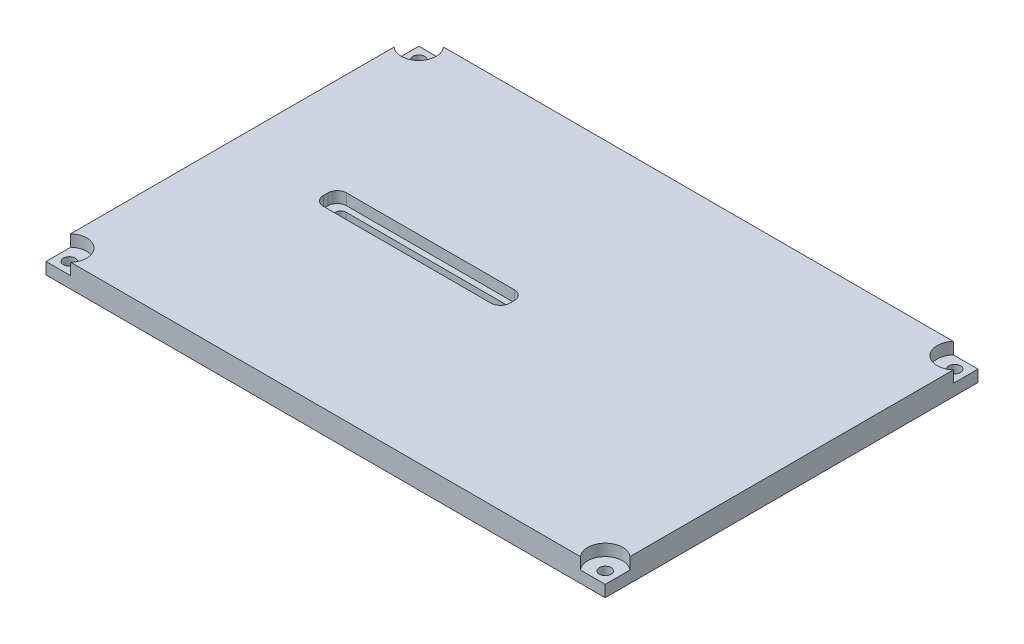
ISO-10303-21;
HEADER;
FILE_DESCRIPTION(('STEP AP214'),'2;1');
FILE_NAME('part.step','',(''),(''),'','','');
FILE_SCHEMA(('AUTOMOTIVE_DESIGN { 1 0 10303 214 1 1 1 1 }'));
ENDSEC;
DATA;
#1=APPLICATION_CONTEXT('core data for automotive mechanical design processes');
#2=APPLICATION_PROTOCOL_DEFINITION('international standard','automotive_design',2000,#1);
#3=PRODUCT_CONTEXT('',#1,'mechanical');
#4=PRODUCT('Part','Part','',(#3));
#5=PRODUCT_RELATED_PRODUCT_CATEGORY('part','',(#4));
#6=PRODUCT_DEFINITION_FORMATION('','',#4);
#7=PRODUCT_DEFINITION_CONTEXT('part definition',#1,'design');
#8=PRODUCT_DEFINITION('design','',#6,#7);
#9=PRODUCT_DEFINITION_SHAPE('','',#8);
#10=(LENGTH_UNIT() NAMED_UNIT(*) SI_UNIT(.MILLI.,.METRE.));
#11=(NAMED_UNIT(*) PLANE_ANGLE_UNIT() SI_UNIT($,.RADIAN.));
#12=(NAMED_UNIT(*) SI_UNIT($,.STERADIAN.) SOLID_ANGLE_UNIT());
#13=UNCERTAINTY_MEASURE_WITH_UNIT(LENGTH_MEASURE(1.E-05),#10,'distance_accuracy_value','');
#14=(GEOMETRIC_REPRESENTATION_CONTEXT(3) GLOBAL_UNCERTAINTY_ASSIGNED_CONTEXT((#13)) GLOBAL_UNIT_ASSIGNED_CONTEXT((#10,
#11,#12)) REPRESENTATION_CONTEXT('',''));
#15=CARTESIAN_POINT('',(0.,0.,0.));
#16=DIRECTION('',(0.,0.,1.));
#17=DIRECTION('',(1.,0.,0.));
#18=AXIS2_PLACEMENT_3D('',#15,#16,#17);
#19=CARTESIAN_POINT('',(76.2,6.35,-50.8));
#20=DIRECTION('',(0.,-1.,0.));
#21=DIRECTION('',(0.,0.,-1.));
#22=AXIS2_PLACEMENT_3D('',#19,#20,#21);
#23=PLANE('',#22);
#24=DIRECTION('',(-1.,0.,0.));
#25=VECTOR('',#24,1.);
#26=CARTESIAN_POINT('',(-50.8,6.35,-3.17500000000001));
#27=LINE('',#26,#25);
#28=CARTESIAN_POINT('',(-2.53999999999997,6.35,-3.17500000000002));
#29=VERTEX_POINT('',#28);
#30=CARTESIAN_POINT('',(-48.26,6.35,-3.17500000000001));
#31=VERTEX_POINT('',#30);
#32=EDGE_CURVE('E334',#29,#31,#27,.T.);
#33=ORIENTED_EDGE('',*,*,#32,.F.);
#34=CARTESIAN_POINT('',(-2.53999999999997,6.35,-0.635000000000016));
#35=DIRECTION('',(0.,-1.,0.));
#36=DIRECTION('',(0.,0.,-1.));
#37=AXIS2_PLACEMENT_3D('',#34,#35,#36);
#38=CIRCLE('',#37,2.54);
#39=CARTESIAN_POINT('',(0.,6.35,-0.635000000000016));
#40=VERTEX_POINT('',#39);
#41=EDGE_CURVE('E434',#29,#40,#38,.T.);
#42=ORIENTED_EDGE('',*,*,#41,.T.);
#43=DIRECTION('',(0.,0.,-1.));
#44=VECTOR('',#43,1.);
#45=CARTESIAN_POINT('',(0.,6.35,-3.17500000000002));
#46=LINE('',#45,#44);
#47=CARTESIAN_POINT('',(0.,6.35,0.634999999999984));
#48=VERTEX_POINT('',#47);
#49=EDGE_CURVE('E307',#48,#40,#46,.T.);
#50=ORIENTED_EDGE('',*,*,#49,.F.);
#51=CARTESIAN_POINT('',(-2.53999999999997,6.35,0.634999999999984));
#52=DIRECTION('',(0.,-1.,0.));
#53=DIRECTION('',(0.,0.,-1.));
#54=AXIS2_PLACEMENT_3D('',#51,#52,#53);
#55=CIRCLE('',#54,2.54);
#56=CARTESIAN_POINT('',(-2.53999999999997,6.35,3.17499999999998));
#57=VERTEX_POINT('',#56);
#58=EDGE_CURVE('E432',#48,#57,#55,.T.);
#59=ORIENTED_EDGE('',*,*,#58,.T.);
#60=DIRECTION('',(1.,0.,0.));
#61=VECTOR('',#60,1.);
#62=CARTESIAN_POINT('',(-50.8,6.35,3.17499999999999));
#63=LINE('',#62,#61);
#64=CARTESIAN_POINT('',(-48.26,6.35,3.17499999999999));
#65=VERTEX_POINT('',#64);
#66=EDGE_CURVE('E322',#65,#57,#63,.T.);
#67=ORIENTED_EDGE('',*,*,#66,.F.);
#68=CARTESIAN_POINT('',(-48.26,6.35,0.63499999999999));
#69=DIRECTION('',(0.,-1.,0.));
#70=DIRECTION('',(0.,0.,-1.));
#71=AXIS2_PLACEMENT_3D('',#68,#69,#70);
#72=CIRCLE('',#71,2.54);
#73=CARTESIAN_POINT('',(-50.8,6.35,0.63499999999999));
#74=VERTEX_POINT('',#73);
#75=EDGE_CURVE('E436',#65,#74,#72,.T.);
#76=ORIENTED_EDGE('',*,*,#75,.T.);
#77=DIRECTION('',(0.,0.,1.));
#78=VECTOR('',#77,1.);
#79=CARTESIAN_POINT('',(-50.8,6.35,-3.17500000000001));
#80=LINE('',#79,#78);
#81=CARTESIAN_POINT('',(-50.8,6.35,-0.635000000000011));
#82=VERTEX_POINT('',#81);
#83=EDGE_CURVE('E337',#82,#74,#80,.T.);
#84=ORIENTED_EDGE('',*,*,#83,.F.);
#85=CARTESIAN_POINT('',(-48.26,6.35,-0.635000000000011));
#86=DIRECTION('',(0.,-1.,0.));
#87=DIRECTION('',(0.,0.,-1.));
#88=AXIS2_PLACEMENT_3D('',#85,#86,#87);
#89=CIRCLE('',#88,2.54);
#90=EDGE_CURVE('E438',#82,#31,#89,.T.);
#91=ORIENTED_EDGE('',*,*,#90,.T.);
#92=EDGE_LOOP('',(#33,#42,#50,#59,#67,#76,#84,#91));
#93=FACE_BOUND('',#92,.T.);
#94=CARTESIAN_POINT('',(73.025,6.35,-47.625));
#95=DIRECTION('',(0.,1.,0.));
#96=DIRECTION('',(0.,0.,1.));
#97=AXIS2_PLACEMENT_3D('',#94,#95,#96);
#98=CIRCLE('',#97,4.76249999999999);
#99=CARTESIAN_POINT('',(69.4752420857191,6.35,-50.8));
#100=VERTEX_POINT('',#99);
#101=CARTESIAN_POINT('',(76.2,6.35,-44.0752420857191));
#102=VERTEX_POINT('',#101);
#103=EDGE_CURVE('E221',#100,#102,#98,.T.);
#104=ORIENTED_EDGE('',*,*,#103,.F.);
#105=DIRECTION('',(-1.,0.,0.));
#106=VECTOR('',#105,1.);
#107=CARTESIAN_POINT('',(-76.2,6.35,-50.8));
#108=LINE('',#107,#106);
#109=CARTESIAN_POINT('',(-69.4752420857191,6.35,-50.8));
#110=VERTEX_POINT('',#109);
#111=EDGE_CURVE('E344',#100,#110,#108,.T.);
#112=ORIENTED_EDGE('',*,*,#111,.T.);
#113=CARTESIAN_POINT('',(-73.025,6.35,-47.625));
#114=DIRECTION('',(0.,1.,0.));
#115=DIRECTION('',(0.,0.,1.));
#116=AXIS2_PLACEMENT_3D('',#113,#114,#115);
#117=CIRCLE('',#116,4.76249999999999);
#118=CARTESIAN_POINT('',(-76.2,6.35,-44.0752420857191));
#119=VERTEX_POINT('',#118);
#120=EDGE_CURVE('E257',#119,#110,#117,.T.);
#121=ORIENTED_EDGE('',*,*,#120,.F.);
#122=DIRECTION('',(0.,0.,1.));
#123=VECTOR('',#122,1.);
#124=CARTESIAN_POINT('',(-76.2,6.35,50.8));
#125=LINE('',#124,#123);
#126=CARTESIAN_POINT('',(-76.2,6.35,44.0752420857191));
#127=VERTEX_POINT('',#126);
#128=EDGE_CURVE('E347',#119,#127,#125,.T.);
#129=ORIENTED_EDGE('',*,*,#128,.T.);
#130=CARTESIAN_POINT('',(-73.025,6.35,47.625));
#131=DIRECTION('',(0.,1.,0.));
#132=DIRECTION('',(0.,0.,1.));
#133=AXIS2_PLACEMENT_3D('',#130,#131,#132);
#134=CIRCLE('',#133,4.76249999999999);
#135=CARTESIAN_POINT('',(-69.4752420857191,6.35,50.8));
#136=VERTEX_POINT('',#135);
#137=EDGE_CURVE('E275',#136,#127,#134,.T.);
#138=ORIENTED_EDGE('',*,*,#137,.F.);
#139=DIRECTION('',(1.,0.,0.));
#140=VECTOR('',#139,1.);
#141=CARTESIAN_POINT('',(-76.2,6.35,50.8));
#142=LINE('',#141,#140);
#143=CARTESIAN_POINT('',(69.475242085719,6.35,50.8));
#144=VERTEX_POINT('',#143);
#145=EDGE_CURVE('E349',#136,#144,#142,.T.);
#146=ORIENTED_EDGE('',*,*,#145,.T.);
#147=CARTESIAN_POINT('',(73.025,6.35,47.625));
#148=DIRECTION('',(0.,1.,0.));
#149=DIRECTION('',(0.,0.,1.));
#150=AXIS2_PLACEMENT_3D('',#147,#148,#149);
#151=CIRCLE('',#150,4.76249999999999);
#152=CARTESIAN_POINT('',(76.2,6.35,44.0752420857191));
#153=VERTEX_POINT('',#152);
#154=EDGE_CURVE('E58',#153,#144,#151,.T.);
#155=ORIENTED_EDGE('',*,*,#154,.F.);
#156=DIRECTION('',(0.,0.,-1.));
#157=VECTOR('',#156,1.);
#158=CARTESIAN_POINT('',(76.2,6.35,50.8));
#159=LINE('',#158,#157);
#160=EDGE_CURVE('E342',#153,#102,#159,.T.);
#161=ORIENTED_EDGE('',*,*,#160,.T.);
#162=EDGE_LOOP('',(#104,#112,#121,#129,#138,#146,#155,#161));
#163=FACE_BOUND('',#162,.T.);
#164=ADVANCED_FACE('F35',(#93,#163),#23,.F.);
#165=CARTESIAN_POINT('',(76.2,6.35,50.8));
#166=DIRECTION('',(-1.,0.,0.));
#167=DIRECTION('',(0.,0.,1.));
#168=AXIS2_PLACEMENT_3D('',#165,#166,#167);
#169=PLANE('',#168);
#170=DIRECTION('',(0.,0.,1.));
#171=VECTOR('',#170,1.);
#172=CARTESIAN_POINT('',(76.2,3.175,50.8));
#173=LINE('',#172,#171);
#174=CARTESIAN_POINT('',(76.2,3.175,-50.8));
#175=VERTEX_POINT('',#174);
#176=CARTESIAN_POINT('',(76.2,3.175,-44.0752420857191));
#177=VERTEX_POINT('',#176);
#178=EDGE_CURVE('E226',#175,#177,#173,.T.);
#179=ORIENTED_EDGE('',*,*,#178,.T.);
#180=DIRECTION('',(0.,1.,0.));
#181=VECTOR('',#180,1.);
#182=CARTESIAN_POINT('',(76.2,6.35,-44.0752420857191));
#183=LINE('',#182,#181);
#184=EDGE_CURVE('E218',#177,#102,#183,.T.);
#185=ORIENTED_EDGE('',*,*,#184,.T.);
#186=ORIENTED_EDGE('',*,*,#160,.F.);
#187=DIRECTION('',(0.,1.,0.));
#188=VECTOR('',#187,1.);
#189=CARTESIAN_POINT('',(76.2,6.35,44.0752420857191));
#190=LINE('',#189,#188);
#191=CARTESIAN_POINT('',(76.2,3.175,44.0752420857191));
#192=VERTEX_POINT('',#191);
#193=EDGE_CURVE('E251',#153,#192,#190,.F.);
#194=ORIENTED_EDGE('',*,*,#193,.T.);
#195=DIRECTION('',(0.,0.,1.));
#196=VECTOR('',#195,1.);
#197=CARTESIAN_POINT('',(76.2,3.175,50.8));
#198=LINE('',#197,#196);
#199=CARTESIAN_POINT('',(76.2,3.175,50.8));
#200=VERTEX_POINT('',#199);
#201=EDGE_CURVE('E254',#192,#200,#198,.T.);
#202=ORIENTED_EDGE('',*,*,#201,.T.);
#203=DIRECTION('',(0.,-1.,0.));
#204=VECTOR('',#203,1.);
#205=CARTESIAN_POINT('',(76.2,6.35,50.8));
#206=LINE('',#205,#204);
#207=CARTESIAN_POINT('',(76.2,0.,50.8));
#208=VERTEX_POINT('',#207);
#209=EDGE_CURVE('E352',#200,#208,#206,.T.);
#210=ORIENTED_EDGE('',*,*,#209,.T.);
#211=DIRECTION('',(0.,0.,-1.));
#212=VECTOR('',#211,1.);
#213=CARTESIAN_POINT('',(76.2,0.,50.8));
#214=LINE('',#213,#212);
#215=CARTESIAN_POINT('',(76.2,0.,-50.8));
#216=VERTEX_POINT('',#215);
#217=EDGE_CURVE('E331',#208,#216,#214,.T.);
#218=ORIENTED_EDGE('',*,*,#217,.T.);
#219=DIRECTION('',(0.,-1.,0.));
#220=VECTOR('',#219,1.);
#221=CARTESIAN_POINT('',(76.2,6.35,-50.8));
#222=LINE('',#221,#220);
#223=EDGE_CURVE('E237',#175,#216,#222,.T.);
#224=ORIENTED_EDGE('',*,*,#223,.F.);
#225=EDGE_LOOP('',(#179,#185,#186,#194,#202,#210,#218,#224));
#226=FACE_BOUND('',#225,.T.);
#227=ADVANCED_FACE('F235',(#226),#169,.F.);
#228=CARTESIAN_POINT('',(-76.2,6.35,-50.8));
#229=DIRECTION('',(0.,0.,1.));
#230=DIRECTION('',(1.,0.,0.));
#231=AXIS2_PLACEMENT_3D('',#228,#229,#230);
#232=PLANE('',#231);
#233=DIRECTION('',(0.,1.,0.));
#234=VECTOR('',#233,1.);
#235=CARTESIAN_POINT('',(69.4752420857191,6.35,-50.8));
#236=LINE('',#235,#234);
#237=CARTESIAN_POINT('',(69.4752420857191,3.175,-50.8));
#238=VERTEX_POINT('',#237);
#239=EDGE_CURVE('E43',#100,#238,#236,.F.);
#240=ORIENTED_EDGE('',*,*,#239,.T.);
#241=DIRECTION('',(1.,0.,0.));
#242=VECTOR('',#241,1.);
#243=CARTESIAN_POINT('',(-76.2,3.175,-50.8));
#244=LINE('',#243,#242);
#245=EDGE_CURVE('E11',#238,#175,#244,.T.);
#246=ORIENTED_EDGE('',*,*,#245,.T.);
#247=ORIENTED_EDGE('',*,*,#223,.T.);
#248=DIRECTION('',(-1.,0.,0.));
#249=VECTOR('',#248,1.);
#250=CARTESIAN_POINT('',(-76.2,0.,-50.8));
#251=LINE('',#250,#249);
#252=CARTESIAN_POINT('',(-76.2,0.,-50.8));
#253=VERTEX_POINT('',#252);
#254=EDGE_CURVE('E354',#216,#253,#251,.T.);
#255=ORIENTED_EDGE('',*,*,#254,.T.);
#256=DIRECTION('',(0.,-1.,0.));
#257=VECTOR('',#256,1.);
#258=CARTESIAN_POINT('',(-76.2,6.35,-50.8));
#259=LINE('',#258,#257);
#260=CARTESIAN_POINT('',(-76.2,3.175,-50.8));
#261=VERTEX_POINT('',#260);
#262=EDGE_CURVE('E365',#261,#253,#259,.T.);
#263=ORIENTED_EDGE('',*,*,#262,.F.);
#264=DIRECTION('',(1.,0.,0.));
#265=VECTOR('',#264,1.);
#266=CARTESIAN_POINT('',(-76.2,3.175,-50.8));
#267=LINE('',#266,#265);
#268=CARTESIAN_POINT('',(-69.4752420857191,3.175,-50.8));
#269=VERTEX_POINT('',#268);
#270=EDGE_CURVE('E272',#261,#269,#267,.T.);
#271=ORIENTED_EDGE('',*,*,#270,.T.);
#272=DIRECTION('',(0.,1.,0.));
#273=VECTOR('',#272,1.);
#274=CARTESIAN_POINT('',(-69.4752420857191,6.35,-50.8));
#275=LINE('',#274,#273);
#276=EDGE_CURVE('E269',#269,#110,#275,.T.);
#277=ORIENTED_EDGE('',*,*,#276,.T.);
#278=ORIENTED_EDGE('',*,*,#111,.F.);
#279=EDGE_LOOP('',(#240,#246,#247,#255,#263,#271,#277,#278));
#280=FACE_BOUND('',#279,.T.);
#281=ADVANCED_FACE('F458',(#280),#232,.F.);
#282=CARTESIAN_POINT('',(-76.2,6.35,50.8));
#283=DIRECTION('',(1.,0.,0.));
#284=DIRECTION('',(0.,0.,-1.));
#285=AXIS2_PLACEMENT_3D('',#282,#283,#284);
#286=PLANE('',#285);
#287=DIRECTION('',(0.,1.,0.));
#288=VECTOR('',#287,1.);
#289=CARTESIAN_POINT('',(-76.2,6.35,-44.0752420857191));
#290=LINE('',#289,#288);
#291=CARTESIAN_POINT('',(-76.2,3.175,-44.0752420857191));
#292=VERTEX_POINT('',#291);
#293=EDGE_CURVE('E446',#119,#292,#290,.F.);
#294=ORIENTED_EDGE('',*,*,#293,.T.);
#295=DIRECTION('',(0.,0.,-1.));
#296=VECTOR('',#295,1.);
#297=CARTESIAN_POINT('',(-76.2,3.175,50.8));
#298=LINE('',#297,#296);
#299=EDGE_CURVE('E449',#292,#261,#298,.T.);
#300=ORIENTED_EDGE('',*,*,#299,.T.);
#301=ORIENTED_EDGE('',*,*,#262,.T.);
#302=DIRECTION('',(0.,0.,1.));
#303=VECTOR('',#302,1.);
#304=CARTESIAN_POINT('',(-76.2,0.,50.8));
#305=LINE('',#304,#303);
#306=CARTESIAN_POINT('',(-76.2,0.,50.8));
#307=VERTEX_POINT('',#306);
#308=EDGE_CURVE('E357',#253,#307,#305,.T.);
#309=ORIENTED_EDGE('',*,*,#308,.T.);
#310=DIRECTION('',(0.,-1.,0.));
#311=VECTOR('',#310,1.);
#312=CARTESIAN_POINT('',(-76.2,6.35,50.8));
#313=LINE('',#312,#311);
#314=CARTESIAN_POINT('',(-76.2,3.175,50.8));
#315=VERTEX_POINT('',#314);
#316=EDGE_CURVE('E363',#315,#307,#313,.T.);
#317=ORIENTED_EDGE('',*,*,#316,.F.);
#318=DIRECTION('',(0.,0.,-1.));
#319=VECTOR('',#318,1.);
#320=CARTESIAN_POINT('',(-76.2,3.175,50.8));
#321=LINE('',#320,#319);
#322=CARTESIAN_POINT('',(-76.2,3.175,44.0752420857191));
#323=VERTEX_POINT('',#322);
#324=EDGE_CURVE('E443',#315,#323,#321,.T.);
#325=ORIENTED_EDGE('',*,*,#324,.T.);
#326=DIRECTION('',(0.,1.,0.));
#327=VECTOR('',#326,1.);
#328=CARTESIAN_POINT('',(-76.2,6.35,44.0752420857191));
#329=LINE('',#328,#327);
#330=EDGE_CURVE('E290',#323,#127,#329,.T.);
#331=ORIENTED_EDGE('',*,*,#330,.T.);
#332=ORIENTED_EDGE('',*,*,#128,.F.);
#333=EDGE_LOOP('',(#294,#300,#301,#309,#317,#325,#331,#332));
#334=FACE_BOUND('',#333,.T.);
#335=ADVANCED_FACE('F504',(#334),#286,.F.);
#336=CARTESIAN_POINT('',(-76.2,6.35,50.8));
#337=DIRECTION('',(0.,0.,-1.));
#338=DIRECTION('',(-1.,0.,0.));
#339=AXIS2_PLACEMENT_3D('',#336,#337,#338);
#340=PLANE('',#339);
#341=ORIENTED_EDGE('',*,*,#209,.F.);
#342=DIRECTION('',(-1.,0.,0.));
#343=VECTOR('',#342,1.);
#344=CARTESIAN_POINT('',(-76.2,3.175,50.8));
#345=LINE('',#344,#343);
#346=CARTESIAN_POINT('',(69.4752420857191,3.175,50.8));
#347=VERTEX_POINT('',#346);
#348=EDGE_CURVE('E454',#200,#347,#345,.T.);
#349=ORIENTED_EDGE('',*,*,#348,.T.);
#350=DIRECTION('',(0.,1.,0.));
#351=VECTOR('',#350,1.);
#352=CARTESIAN_POINT('',(69.4752420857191,6.35,50.8));
#353=LINE('',#352,#351);
#354=EDGE_CURVE('E452',#347,#144,#353,.T.);
#355=ORIENTED_EDGE('',*,*,#354,.T.);
#356=ORIENTED_EDGE('',*,*,#145,.F.);
#357=DIRECTION('',(0.,1.,0.));
#358=VECTOR('',#357,1.);
#359=CARTESIAN_POINT('',(-69.4752420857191,6.35,50.8));
#360=LINE('',#359,#358);
#361=CARTESIAN_POINT('',(-69.4752420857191,3.175,50.8));
#362=VERTEX_POINT('',#361);
#363=EDGE_CURVE('E287',#136,#362,#360,.F.);
#364=ORIENTED_EDGE('',*,*,#363,.T.);
#365=DIRECTION('',(-1.,0.,0.));
#366=VECTOR('',#365,1.);
#367=CARTESIAN_POINT('',(-76.2,3.175,50.8));
#368=LINE('',#367,#366);
#369=EDGE_CURVE('E440',#362,#315,#368,.T.);
#370=ORIENTED_EDGE('',*,*,#369,.T.);
#371=ORIENTED_EDGE('',*,*,#316,.T.);
#372=DIRECTION('',(1.,0.,0.));
#373=VECTOR('',#372,1.);
#374=CARTESIAN_POINT('',(-76.2,0.,50.8));
#375=LINE('',#374,#373);
#376=EDGE_CURVE('E345',#307,#208,#375,.T.);
#377=ORIENTED_EDGE('',*,*,#376,.T.);
#378=EDGE_LOOP('',(#341,#349,#355,#356,#364,#370,#371,#377));
#379=FACE_BOUND('',#378,.T.);
#380=ADVANCED_FACE('F501',(#379),#340,.F.);
#381=CARTESIAN_POINT('',(76.2,0.,-50.8));
#382=DIRECTION('',(0.,-1.,0.));
#383=DIRECTION('',(0.,0.,-1.));
#384=AXIS2_PLACEMENT_3D('',#381,#382,#383);
#385=PLANE('',#384);
#386=CARTESIAN_POINT('',(73.025,0.,-47.625));
#387=DIRECTION('',(0.,1.,0.));
#388=DIRECTION('',(0.,0.,1.));
#389=AXIS2_PLACEMENT_3D('',#386,#387,#388);
#390=CIRCLE('',#389,1.58749999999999);
#391=CARTESIAN_POINT('',(73.025,0.,-46.0375));
#392=VERTEX_POINT('',#391);
#393=EDGE_CURVE('E227',#392,#392,#390,.T.);
#394=ORIENTED_EDGE('',*,*,#393,.T.);
#395=EDGE_LOOP('',(#394));
#396=FACE_BOUND('',#395,.T.);
#397=CARTESIAN_POINT('',(73.025,0.,47.625));
#398=DIRECTION('',(0.,1.,0.));
#399=DIRECTION('',(0.,0.,1.));
#400=AXIS2_PLACEMENT_3D('',#397,#398,#399);
#401=CIRCLE('',#400,1.58749999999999);
#402=CARTESIAN_POINT('',(73.025,0.,49.2125));
#403=VERTEX_POINT('',#402);
#404=EDGE_CURVE('E248',#403,#403,#401,.T.);
#405=ORIENTED_EDGE('',*,*,#404,.T.);
#406=EDGE_LOOP('',(#405));
#407=FACE_BOUND('',#406,.T.);
#408=CARTESIAN_POINT('',(-73.025,0.,-47.625));
#409=DIRECTION('',(0.,1.,0.));
#410=DIRECTION('',(0.,0.,1.));
#411=AXIS2_PLACEMENT_3D('',#408,#409,#410);
#412=CIRCLE('',#411,1.58749999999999);
#413=CARTESIAN_POINT('',(-73.025,0.,-46.0375));
#414=VERTEX_POINT('',#413);
#415=EDGE_CURVE('E266',#414,#414,#412,.T.);
#416=ORIENTED_EDGE('',*,*,#415,.T.);
#417=EDGE_LOOP('',(#416));
#418=FACE_BOUND('',#417,.T.);
#419=CARTESIAN_POINT('',(-73.025,0.,47.625));
#420=DIRECTION('',(0.,1.,0.));
#421=DIRECTION('',(0.,0.,1.));
#422=AXIS2_PLACEMENT_3D('',#419,#420,#421);
#423=CIRCLE('',#422,1.58749999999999);
#424=CARTESIAN_POINT('',(-73.025,0.,49.2125));
#425=VERTEX_POINT('',#424);
#426=EDGE_CURVE('E284',#425,#425,#423,.T.);
#427=ORIENTED_EDGE('',*,*,#426,.T.);
#428=EDGE_LOOP('',(#427));
#429=FACE_BOUND('',#428,.T.);
#430=DIRECTION('',(0.,0.,1.));
#431=VECTOR('',#430,1.);
#432=CARTESIAN_POINT('',(-48.26,0.,-1.58750000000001));
#433=LINE('',#432,#431);
#434=CARTESIAN_POINT('',(-48.26,0.,-0.152400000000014));
#435=VERTEX_POINT('',#434);
#436=CARTESIAN_POINT('',(-48.26,0.,0.152399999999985));
#437=VERTEX_POINT('',#436);
#438=EDGE_CURVE('E304',#435,#437,#433,.T.);
#439=ORIENTED_EDGE('',*,*,#438,.T.);
#440=CARTESIAN_POINT('',(-46.8249,0.,0.152399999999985));
#441=DIRECTION('',(0.,-1.,0.));
#442=DIRECTION('',(0.,0.,-1.));
#443=AXIS2_PLACEMENT_3D('',#440,#441,#442);
#444=CIRCLE('',#443,1.4351);
#445=CARTESIAN_POINT('',(-46.8249,0.,1.58749999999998));
#446=VERTEX_POINT('',#445);
#447=EDGE_CURVE('E398',#437,#446,#444,.F.);
#448=ORIENTED_EDGE('',*,*,#447,.T.);
#449=DIRECTION('',(1.,0.,0.));
#450=VECTOR('',#449,1.);
#451=CARTESIAN_POINT('',(-48.26,0.,1.58749999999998));
#452=LINE('',#451,#450);
#453=CARTESIAN_POINT('',(-3.97509999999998,0.,1.58749999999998));
#454=VERTEX_POINT('',#453);
#455=EDGE_CURVE('E294',#446,#454,#452,.T.);
#456=ORIENTED_EDGE('',*,*,#455,.T.);
#457=CARTESIAN_POINT('',(-3.97509999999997,0.,0.152399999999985));
#458=DIRECTION('',(0.,-1.,0.));
#459=DIRECTION('',(0.,0.,-1.));
#460=AXIS2_PLACEMENT_3D('',#457,#458,#459);
#461=CIRCLE('',#460,1.4351);
#462=CARTESIAN_POINT('',(-2.53999999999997,0.,0.152399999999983));
#463=VERTEX_POINT('',#462);
#464=EDGE_CURVE('E390',#454,#463,#461,.F.);
#465=ORIENTED_EDGE('',*,*,#464,.T.);
#466=DIRECTION('',(0.,0.,-1.));
#467=VECTOR('',#466,1.);
#468=CARTESIAN_POINT('',(-2.53999999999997,0.,1.58749999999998));
#469=LINE('',#468,#467);
#470=CARTESIAN_POINT('',(-2.53999999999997,0.,-0.152400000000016));
#471=VERTEX_POINT('',#470);
#472=EDGE_CURVE('E297',#463,#471,#469,.T.);
#473=ORIENTED_EDGE('',*,*,#472,.T.);
#474=CARTESIAN_POINT('',(-3.97509999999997,0.,-0.152400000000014));
#475=DIRECTION('',(0.,-1.,0.));
#476=DIRECTION('',(0.,0.,-1.));
#477=AXIS2_PLACEMENT_3D('',#474,#475,#476);
#478=CIRCLE('',#477,1.4351);
#479=CARTESIAN_POINT('',(-3.97509999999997,0.,-1.58750000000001));
#480=VERTEX_POINT('',#479);
#481=EDGE_CURVE('E394',#471,#480,#478,.F.);
#482=ORIENTED_EDGE('',*,*,#481,.T.);
#483=DIRECTION('',(-1.,0.,0.));
#484=VECTOR('',#483,1.);
#485=CARTESIAN_POINT('',(-2.53999999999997,0.,-1.58750000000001));
#486=LINE('',#485,#484);
#487=CARTESIAN_POINT('',(-46.8249,0.,-1.58750000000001));
#488=VERTEX_POINT('',#487);
#489=EDGE_CURVE('E301',#480,#488,#486,.T.);
#490=ORIENTED_EDGE('',*,*,#489,.T.);
#491=CARTESIAN_POINT('',(-46.8249,0.,-0.152400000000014));
#492=DIRECTION('',(0.,-1.,0.));
#493=DIRECTION('',(0.,0.,-1.));
#494=AXIS2_PLACEMENT_3D('',#491,#492,#493);
#495=CIRCLE('',#494,1.4351);
#496=EDGE_CURVE('E402',#488,#435,#495,.F.);
#497=ORIENTED_EDGE('',*,*,#496,.T.);
#498=EDGE_LOOP('',(#439,#448,#456,#465,#473,#482,#490,#497));
#499=FACE_BOUND('',#498,.T.);
#500=ORIENTED_EDGE('',*,*,#217,.F.);
#501=ORIENTED_EDGE('',*,*,#376,.F.);
#502=ORIENTED_EDGE('',*,*,#308,.F.);
#503=ORIENTED_EDGE('',*,*,#254,.F.);
#504=EDGE_LOOP('',(#500,#501,#502,#503));
#505=FACE_BOUND('',#504,.T.);
#506=ADVANCED_FACE('F467',(#396,#407,#418,#429,#499,#505),#385,.T.);
#507=CARTESIAN_POINT('',(0.,3.302,-3.17500000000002));
#508=DIRECTION('',(1.,0.,0.));
#509=DIRECTION('',(0.,0.,-1.));
#510=AXIS2_PLACEMENT_3D('',#507,#508,#509);
#511=PLANE('',#510);
#512=DIRECTION('',(0.,0.,-1.));
#513=VECTOR('',#512,1.);
#514=CARTESIAN_POINT('',(0.,3.302,-3.17500000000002));
#515=LINE('',#514,#513);
#516=CARTESIAN_POINT('',(0.,3.302,0.634999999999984));
#517=VERTEX_POINT('',#516);
#518=CARTESIAN_POINT('',(0.,3.302,-0.635000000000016));
#519=VERTEX_POINT('',#518);
#520=EDGE_CURVE('E318',#517,#519,#515,.T.);
#521=ORIENTED_EDGE('',*,*,#520,.F.);
#522=DIRECTION('',(0.,1.,0.));
#523=VECTOR('',#522,1.);
#524=CARTESIAN_POINT('',(0.,6.35,0.634999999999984));
#525=LINE('',#524,#523);
#526=EDGE_CURVE('E406',#517,#48,#525,.T.);
#527=ORIENTED_EDGE('',*,*,#526,.T.);
#528=ORIENTED_EDGE('',*,*,#49,.T.);
#529=DIRECTION('',(0.,1.,0.));
#530=VECTOR('',#529,1.);
#531=CARTESIAN_POINT('',(0.,3.302,-0.635000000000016));
#532=LINE('',#531,#530);
#533=EDGE_CURVE('E404',#40,#519,#532,.F.);
#534=ORIENTED_EDGE('',*,*,#533,.T.);
#535=EDGE_LOOP('',(#521,#527,#528,#534));
#536=FACE_BOUND('',#535,.T.);
#537=ADVANCED_FACE('F497',(#536),#511,.F.);
#538=CARTESIAN_POINT('',(-50.8,3.302,3.17499999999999));
#539=DIRECTION('',(0.,0.,1.));
#540=DIRECTION('',(1.,0.,0.));
#541=AXIS2_PLACEMENT_3D('',#538,#539,#540);
#542=PLANE('',#541);
#543=ORIENTED_EDGE('',*,*,#66,.T.);
#544=DIRECTION('',(0.,1.,0.));
#545=VECTOR('',#544,1.);
#546=CARTESIAN_POINT('',(-2.53999999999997,3.302,3.17499999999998));
#547=LINE('',#546,#545);
#548=CARTESIAN_POINT('',(-2.53999999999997,3.302,3.17499999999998));
#549=VERTEX_POINT('',#548);
#550=EDGE_CURVE('E412',#57,#549,#547,.F.);
#551=ORIENTED_EDGE('',*,*,#550,.T.);
#552=DIRECTION('',(1.,0.,0.));
#553=VECTOR('',#552,1.);
#554=CARTESIAN_POINT('',(-50.8,3.302,3.17499999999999));
#555=LINE('',#554,#553);
#556=CARTESIAN_POINT('',(-48.26,3.302,3.17499999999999));
#557=VERTEX_POINT('',#556);
#558=EDGE_CURVE('E328',#557,#549,#555,.T.);
#559=ORIENTED_EDGE('',*,*,#558,.F.);
#560=DIRECTION('',(0.,1.,0.));
#561=VECTOR('',#560,1.);
#562=CARTESIAN_POINT('',(-48.26,6.35,3.17499999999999));
#563=LINE('',#562,#561);
#564=EDGE_CURVE('E409',#557,#65,#563,.T.);
#565=ORIENTED_EDGE('',*,*,#564,.T.);
#566=EDGE_LOOP('',(#543,#551,#559,#565));
#567=FACE_BOUND('',#566,.T.);
#568=ADVANCED_FACE('F552',(#567),#542,.F.);
#569=CARTESIAN_POINT('',(-50.8,3.302,-3.17500000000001));
#570=DIRECTION('',(-1.,0.,0.));
#571=DIRECTION('',(0.,0.,1.));
#572=AXIS2_PLACEMENT_3D('',#569,#570,#571);
#573=PLANE('',#572);
#574=ORIENTED_EDGE('',*,*,#83,.T.);
#575=DIRECTION('',(0.,1.,0.));
#576=VECTOR('',#575,1.);
#577=CARTESIAN_POINT('',(-50.8,3.302,0.63499999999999));
#578=LINE('',#577,#576);
#579=CARTESIAN_POINT('',(-50.8,3.302,0.63499999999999));
#580=VERTEX_POINT('',#579);
#581=EDGE_CURVE('E430',#74,#580,#578,.F.);
#582=ORIENTED_EDGE('',*,*,#581,.T.);
#583=DIRECTION('',(0.,0.,1.));
#584=VECTOR('',#583,1.);
#585=CARTESIAN_POINT('',(-50.8,3.302,-3.17500000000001));
#586=LINE('',#585,#584);
#587=CARTESIAN_POINT('',(-50.8,3.302,-0.635000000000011));
#588=VERTEX_POINT('',#587);
#589=EDGE_CURVE('E325',#588,#580,#586,.T.);
#590=ORIENTED_EDGE('',*,*,#589,.F.);
#591=DIRECTION('',(0.,1.,0.));
#592=VECTOR('',#591,1.);
#593=CARTESIAN_POINT('',(-50.8,6.35,-0.635000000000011));
#594=LINE('',#593,#592);
#595=EDGE_CURVE('E427',#588,#82,#594,.T.);
#596=ORIENTED_EDGE('',*,*,#595,.T.);
#597=EDGE_LOOP('',(#574,#582,#590,#596));
#598=FACE_BOUND('',#597,.T.);
#599=ADVANCED_FACE('F569',(#598),#573,.F.);
#600=CARTESIAN_POINT('',(-50.8,3.302,-3.17500000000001));
#601=DIRECTION('',(0.,0.,-1.));
#602=DIRECTION('',(-1.,0.,0.));
#603=AXIS2_PLACEMENT_3D('',#600,#601,#602);
#604=PLANE('',#603);
#605=DIRECTION('',(-1.,0.,0.));
#606=VECTOR('',#605,1.);
#607=CARTESIAN_POINT('',(-50.8,3.302,-3.17500000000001));
#608=LINE('',#607,#606);
#609=CARTESIAN_POINT('',(-2.53999999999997,3.302,-3.17500000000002));
#610=VERTEX_POINT('',#609);
#611=CARTESIAN_POINT('',(-48.26,3.302,-3.17500000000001));
#612=VERTEX_POINT('',#611);
#613=EDGE_CURVE('E321',#610,#612,#608,.T.);
#614=ORIENTED_EDGE('',*,*,#613,.F.);
#615=DIRECTION('',(0.,1.,0.));
#616=VECTOR('',#615,1.);
#617=CARTESIAN_POINT('',(-2.53999999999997,6.35,-3.17500000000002));
#618=LINE('',#617,#616);
#619=EDGE_CURVE('E424',#610,#29,#618,.T.);
#620=ORIENTED_EDGE('',*,*,#619,.T.);
#621=ORIENTED_EDGE('',*,*,#32,.T.);
#622=DIRECTION('',(0.,1.,0.));
#623=VECTOR('',#622,1.);
#624=CARTESIAN_POINT('',(-48.26,3.302,-3.17500000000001));
#625=LINE('',#624,#623);
#626=EDGE_CURVE('E422',#31,#612,#625,.F.);
#627=ORIENTED_EDGE('',*,*,#626,.T.);
#628=EDGE_LOOP('',(#614,#620,#621,#627));
#629=FACE_BOUND('',#628,.T.);
#630=ADVANCED_FACE('F565',(#629),#604,.F.);
#631=CARTESIAN_POINT('',(0.,3.302,3.17499999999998));
#632=DIRECTION('',(0.,1.,0.));
#633=DIRECTION('',(0.,0.,1.));
#634=AXIS2_PLACEMENT_3D('',#631,#632,#633);
#635=PLANE('',#634);
#636=DIRECTION('',(1.,0.,0.));
#637=VECTOR('',#636,1.);
#638=CARTESIAN_POINT('',(-48.26,3.302,1.58749999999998));
#639=LINE('',#638,#637);
#640=CARTESIAN_POINT('',(-46.8249,3.302,1.58749999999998));
#641=VERTEX_POINT('',#640);
#642=CARTESIAN_POINT('',(-3.97509999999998,3.302,1.58749999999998));
#643=VERTEX_POINT('',#642);
#644=EDGE_CURVE('E293',#641,#643,#639,.T.);
#645=ORIENTED_EDGE('',*,*,#644,.F.);
#646=CARTESIAN_POINT('',(-46.8249,3.302,0.152399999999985));
#647=DIRECTION('',(0.,1.,0.));
#648=DIRECTION('',(0.,0.,1.));
#649=AXIS2_PLACEMENT_3D('',#646,#647,#648);
#650=CIRCLE('',#649,1.4351);
#651=CARTESIAN_POINT('',(-48.26,3.302,0.152399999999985));
#652=VERTEX_POINT('',#651);
#653=EDGE_CURVE('E396',#641,#652,#650,.F.);
#654=ORIENTED_EDGE('',*,*,#653,.T.);
#655=DIRECTION('',(0.,0.,1.));
#656=VECTOR('',#655,1.);
#657=CARTESIAN_POINT('',(-48.26,3.302,-1.58750000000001));
#658=LINE('',#657,#656);
#659=CARTESIAN_POINT('',(-48.26,3.302,-0.152400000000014));
#660=VERTEX_POINT('',#659);
#661=EDGE_CURVE('E298',#660,#652,#658,.T.);
#662=ORIENTED_EDGE('',*,*,#661,.F.);
#663=CARTESIAN_POINT('',(-46.8249,3.302,-0.152400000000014));
#664=DIRECTION('',(0.,1.,0.));
#665=DIRECTION('',(0.,0.,1.));
#666=AXIS2_PLACEMENT_3D('',#663,#664,#665);
#667=CIRCLE('',#666,1.4351);
#668=CARTESIAN_POINT('',(-46.8249,3.302,-1.58750000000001));
#669=VERTEX_POINT('',#668);
#670=EDGE_CURVE('E400',#660,#669,#667,.F.);
#671=ORIENTED_EDGE('',*,*,#670,.T.);
#672=DIRECTION('',(-1.,0.,0.));
#673=VECTOR('',#672,1.);
#674=CARTESIAN_POINT('',(-2.53999999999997,3.302,-1.58750000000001));
#675=LINE('',#674,#673);
#676=CARTESIAN_POINT('',(-3.97509999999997,3.302,-1.58750000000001));
#677=VERTEX_POINT('',#676);
#678=EDGE_CURVE('E313',#677,#669,#675,.T.);
#679=ORIENTED_EDGE('',*,*,#678,.F.);
#680=CARTESIAN_POINT('',(-3.97509999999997,3.302,-0.152400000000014));
#681=DIRECTION('',(0.,1.,0.));
#682=DIRECTION('',(0.,0.,1.));
#683=AXIS2_PLACEMENT_3D('',#680,#681,#682);
#684=CIRCLE('',#683,1.4351);
#685=CARTESIAN_POINT('',(-2.53999999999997,3.302,-0.152400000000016));
#686=VERTEX_POINT('',#685);
#687=EDGE_CURVE('E392',#677,#686,#684,.F.);
#688=ORIENTED_EDGE('',*,*,#687,.T.);
#689=DIRECTION('',(0.,0.,-1.));
#690=VECTOR('',#689,1.);
#691=CARTESIAN_POINT('',(-2.53999999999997,3.302,1.58749999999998));
#692=LINE('',#691,#690);
#693=CARTESIAN_POINT('',(-2.53999999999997,3.302,0.152399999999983));
#694=VERTEX_POINT('',#693);
#695=EDGE_CURVE('E310',#694,#686,#692,.T.);
#696=ORIENTED_EDGE('',*,*,#695,.F.);
#697=CARTESIAN_POINT('',(-3.97509999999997,3.302,0.152399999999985));
#698=DIRECTION('',(0.,1.,0.));
#699=DIRECTION('',(0.,0.,1.));
#700=AXIS2_PLACEMENT_3D('',#697,#698,#699);
#701=CIRCLE('',#700,1.4351);
#702=EDGE_CURVE('E388',#694,#643,#701,.F.);
#703=ORIENTED_EDGE('',*,*,#702,.T.);
#704=EDGE_LOOP('',(#645,#654,#662,#671,#679,#688,#696,#703));
#705=FACE_BOUND('',#704,.T.);
#706=ORIENTED_EDGE('',*,*,#558,.T.);
#707=CARTESIAN_POINT('',(-2.53999999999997,3.302,0.634999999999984));
#708=DIRECTION('',(0.,1.,0.));
#709=DIRECTION('',(0.,0.,1.));
#710=AXIS2_PLACEMENT_3D('',#707,#708,#709);
#711=CIRCLE('',#710,2.54);
#712=EDGE_CURVE('E420',#549,#517,#711,.T.);
#713=ORIENTED_EDGE('',*,*,#712,.T.);
#714=ORIENTED_EDGE('',*,*,#520,.T.);
#715=CARTESIAN_POINT('',(-2.53999999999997,3.302,-0.635000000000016));
#716=DIRECTION('',(0.,1.,0.));
#717=DIRECTION('',(0.,0.,1.));
#718=AXIS2_PLACEMENT_3D('',#715,#716,#717);
#719=CIRCLE('',#718,2.54);
#720=EDGE_CURVE('E418',#519,#610,#719,.T.);
#721=ORIENTED_EDGE('',*,*,#720,.T.);
#722=ORIENTED_EDGE('',*,*,#613,.T.);
#723=CARTESIAN_POINT('',(-48.26,3.302,-0.635000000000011));
#724=DIRECTION('',(0.,1.,0.));
#725=DIRECTION('',(0.,0.,1.));
#726=AXIS2_PLACEMENT_3D('',#723,#724,#725);
#727=CIRCLE('',#726,2.54);
#728=EDGE_CURVE('E414',#612,#588,#727,.T.);
#729=ORIENTED_EDGE('',*,*,#728,.T.);
#730=ORIENTED_EDGE('',*,*,#589,.T.);
#731=CARTESIAN_POINT('',(-48.26,3.302,0.63499999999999));
#732=DIRECTION('',(0.,1.,0.));
#733=DIRECTION('',(0.,0.,1.));
#734=AXIS2_PLACEMENT_3D('',#731,#732,#733);
#735=CIRCLE('',#734,2.54);
#736=EDGE_CURVE('E416',#580,#557,#735,.T.);
#737=ORIENTED_EDGE('',*,*,#736,.T.);
#738=EDGE_LOOP('',(#706,#713,#714,#721,#722,#729,#730,#737));
#739=FACE_BOUND('',#738,.T.);
#740=ADVANCED_FACE('F548',(#705,#739),#635,.T.);
#741=CARTESIAN_POINT('',(-48.26,0.,1.58749999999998));
#742=DIRECTION('',(0.,0.,1.));
#743=DIRECTION('',(1.,0.,0.));
#744=AXIS2_PLACEMENT_3D('',#741,#742,#743);
#745=PLANE('',#744);
#746=ORIENTED_EDGE('',*,*,#644,.T.);
#747=DIRECTION('',(0.,1.,0.));
#748=VECTOR('',#747,1.);
#749=CARTESIAN_POINT('',(-3.97509999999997,0.,1.58749999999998));
#750=LINE('',#749,#748);
#751=EDGE_CURVE('E376',#643,#454,#750,.F.);
#752=ORIENTED_EDGE('',*,*,#751,.T.);
#753=ORIENTED_EDGE('',*,*,#455,.F.);
#754=DIRECTION('',(0.,1.,0.));
#755=VECTOR('',#754,1.);
#756=CARTESIAN_POINT('',(-46.8249,3.302,1.58749999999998));
#757=LINE('',#756,#755);
#758=EDGE_CURVE('E373',#446,#641,#757,.T.);
#759=ORIENTED_EDGE('',*,*,#758,.T.);
#760=EDGE_LOOP('',(#746,#752,#753,#759));
#761=FACE_BOUND('',#760,.T.);
#762=ADVANCED_FACE('F581',(#761),#745,.F.);
#763=CARTESIAN_POINT('',(-48.26,0.,-1.58750000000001));
#764=DIRECTION('',(-1.,0.,0.));
#765=DIRECTION('',(0.,0.,1.));
#766=AXIS2_PLACEMENT_3D('',#763,#764,#765);
#767=PLANE('',#766);
#768=ORIENTED_EDGE('',*,*,#661,.T.);
#769=DIRECTION('',(0.,1.,0.));
#770=VECTOR('',#769,1.);
#771=CARTESIAN_POINT('',(-48.26,0.,0.152399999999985));
#772=LINE('',#771,#770);
#773=EDGE_CURVE('E386',#652,#437,#772,.F.);
#774=ORIENTED_EDGE('',*,*,#773,.T.);
#775=ORIENTED_EDGE('',*,*,#438,.F.);
#776=DIRECTION('',(0.,1.,0.));
#777=VECTOR('',#776,1.);
#778=CARTESIAN_POINT('',(-48.26,3.302,-0.152400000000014));
#779=LINE('',#778,#777);
#780=EDGE_CURVE('E383',#435,#660,#779,.T.);
#781=ORIENTED_EDGE('',*,*,#780,.T.);
#782=EDGE_LOOP('',(#768,#774,#775,#781));
#783=FACE_BOUND('',#782,.T.);
#784=ADVANCED_FACE('F585',(#783),#767,.F.);
#785=CARTESIAN_POINT('',(-2.53999999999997,0.,-1.58750000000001));
#786=DIRECTION('',(0.,0.,-1.));
#787=DIRECTION('',(-1.,0.,0.));
#788=AXIS2_PLACEMENT_3D('',#785,#786,#787);
#789=PLANE('',#788);
#790=ORIENTED_EDGE('',*,*,#489,.F.);
#791=DIRECTION('',(0.,1.,0.));
#792=VECTOR('',#791,1.);
#793=CARTESIAN_POINT('',(-3.97509999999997,3.302,-1.58750000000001));
#794=LINE('',#793,#792);
#795=EDGE_CURVE('E380',#480,#677,#794,.T.);
#796=ORIENTED_EDGE('',*,*,#795,.T.);
#797=ORIENTED_EDGE('',*,*,#678,.T.);
#798=DIRECTION('',(0.,1.,0.));
#799=VECTOR('',#798,1.);
#800=CARTESIAN_POINT('',(-46.8249,0.,-1.58750000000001));
#801=LINE('',#800,#799);
#802=EDGE_CURVE('E378',#669,#488,#801,.F.);
#803=ORIENTED_EDGE('',*,*,#802,.T.);
#804=EDGE_LOOP('',(#790,#796,#797,#803));
#805=FACE_BOUND('',#804,.T.);
#806=ADVANCED_FACE('F589',(#805),#789,.F.);
#807=CARTESIAN_POINT('',(-2.53999999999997,0.,1.58749999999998));
#808=DIRECTION('',(1.,0.,0.));
#809=DIRECTION('',(0.,0.,-1.));
#810=AXIS2_PLACEMENT_3D('',#807,#808,#809);
#811=PLANE('',#810);
#812=ORIENTED_EDGE('',*,*,#472,.F.);
#813=DIRECTION('',(0.,1.,0.));
#814=VECTOR('',#813,1.);
#815=CARTESIAN_POINT('',(-2.53999999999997,3.302,0.152399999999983));
#816=LINE('',#815,#814);
#817=EDGE_CURVE('E370',#463,#694,#816,.T.);
#818=ORIENTED_EDGE('',*,*,#817,.T.);
#819=ORIENTED_EDGE('',*,*,#695,.T.);
#820=DIRECTION('',(0.,1.,0.));
#821=VECTOR('',#820,1.);
#822=CARTESIAN_POINT('',(-2.53999999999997,0.,-0.152400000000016));
#823=LINE('',#822,#821);
#824=EDGE_CURVE('E368',#686,#471,#823,.F.);
#825=ORIENTED_EDGE('',*,*,#824,.T.);
#826=EDGE_LOOP('',(#812,#818,#819,#825));
#827=FACE_BOUND('',#826,.T.);
#828=ADVANCED_FACE('F515',(#827),#811,.F.);
#829=CARTESIAN_POINT('',(-3.97509999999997,0.,0.152399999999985));
#830=DIRECTION('',(0.,-1.,0.));
#831=DIRECTION('',(0.,0.,-1.));
#832=AXIS2_PLACEMENT_3D('',#829,#830,#831);
#833=CYLINDRICAL_SURFACE('',#832,1.4351);
#834=ORIENTED_EDGE('',*,*,#464,.F.);
#835=ORIENTED_EDGE('',*,*,#751,.F.);
#836=ORIENTED_EDGE('',*,*,#702,.F.);
#837=ORIENTED_EDGE('',*,*,#817,.F.);
#838=EDGE_LOOP('',(#834,#835,#836,#837));
#839=FACE_BOUND('',#838,.T.);
#840=ADVANCED_FACE('F511',(#839),#833,.F.);
#841=CARTESIAN_POINT('',(-3.97509999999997,0.,-0.152400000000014));
#842=DIRECTION('',(0.,-1.,0.));
#843=DIRECTION('',(0.,0.,-1.));
#844=AXIS2_PLACEMENT_3D('',#841,#842,#843);
#845=CYLINDRICAL_SURFACE('',#844,1.4351);
#846=ORIENTED_EDGE('',*,*,#481,.F.);
#847=ORIENTED_EDGE('',*,*,#824,.F.);
#848=ORIENTED_EDGE('',*,*,#687,.F.);
#849=ORIENTED_EDGE('',*,*,#795,.F.);
#850=EDGE_LOOP('',(#846,#847,#848,#849));
#851=FACE_BOUND('',#850,.T.);
#852=ADVANCED_FACE('F514',(#851),#845,.F.);
#853=CARTESIAN_POINT('',(-46.8249,0.,0.152399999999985));
#854=DIRECTION('',(0.,-1.,0.));
#855=DIRECTION('',(0.,0.,-1.));
#856=AXIS2_PLACEMENT_3D('',#853,#854,#855);
#857=CYLINDRICAL_SURFACE('',#856,1.4351);
#858=ORIENTED_EDGE('',*,*,#447,.F.);
#859=ORIENTED_EDGE('',*,*,#773,.F.);
#860=ORIENTED_EDGE('',*,*,#653,.F.);
#861=ORIENTED_EDGE('',*,*,#758,.F.);
#862=EDGE_LOOP('',(#858,#859,#860,#861));
#863=FACE_BOUND('',#862,.T.);
#864=ADVANCED_FACE('F519',(#863),#857,.F.);
#865=CARTESIAN_POINT('',(-46.8249,0.,-0.152400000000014));
#866=DIRECTION('',(0.,-1.,0.));
#867=DIRECTION('',(0.,0.,-1.));
#868=AXIS2_PLACEMENT_3D('',#865,#866,#867);
#869=CYLINDRICAL_SURFACE('',#868,1.4351);
#870=ORIENTED_EDGE('',*,*,#496,.F.);
#871=ORIENTED_EDGE('',*,*,#802,.F.);
#872=ORIENTED_EDGE('',*,*,#670,.F.);
#873=ORIENTED_EDGE('',*,*,#780,.F.);
#874=EDGE_LOOP('',(#870,#871,#872,#873));
#875=FACE_BOUND('',#874,.T.);
#876=ADVANCED_FACE('F523',(#875),#869,.F.);
#877=CARTESIAN_POINT('',(-2.53999999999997,3.302,0.634999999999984));
#878=DIRECTION('',(0.,-1.,0.));
#879=DIRECTION('',(0.,0.,-1.));
#880=AXIS2_PLACEMENT_3D('',#877,#878,#879);
#881=CYLINDRICAL_SURFACE('',#880,2.54);
#882=ORIENTED_EDGE('',*,*,#712,.F.);
#883=ORIENTED_EDGE('',*,*,#550,.F.);
#884=ORIENTED_EDGE('',*,*,#58,.F.);
#885=ORIENTED_EDGE('',*,*,#526,.F.);
#886=EDGE_LOOP('',(#882,#883,#884,#885));
#887=FACE_BOUND('',#886,.T.);
#888=ADVANCED_FACE('F527',(#887),#881,.F.);
#889=CARTESIAN_POINT('',(-2.53999999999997,3.302,-0.635000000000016));
#890=DIRECTION('',(0.,-1.,0.));
#891=DIRECTION('',(0.,0.,-1.));
#892=AXIS2_PLACEMENT_3D('',#889,#890,#891);
#893=CYLINDRICAL_SURFACE('',#892,2.54);
#894=ORIENTED_EDGE('',*,*,#720,.F.);
#895=ORIENTED_EDGE('',*,*,#533,.F.);
#896=ORIENTED_EDGE('',*,*,#41,.F.);
#897=ORIENTED_EDGE('',*,*,#619,.F.);
#898=EDGE_LOOP('',(#894,#895,#896,#897));
#899=FACE_BOUND('',#898,.T.);
#900=ADVANCED_FACE('F531',(#899),#893,.F.);
#901=CARTESIAN_POINT('',(-48.26,3.302,0.63499999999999));
#902=DIRECTION('',(0.,-1.,0.));
#903=DIRECTION('',(0.,0.,-1.));
#904=AXIS2_PLACEMENT_3D('',#901,#902,#903);
#905=CYLINDRICAL_SURFACE('',#904,2.54);
#906=ORIENTED_EDGE('',*,*,#736,.F.);
#907=ORIENTED_EDGE('',*,*,#581,.F.);
#908=ORIENTED_EDGE('',*,*,#75,.F.);
#909=ORIENTED_EDGE('',*,*,#564,.F.);
#910=EDGE_LOOP('',(#906,#907,#908,#909));
#911=FACE_BOUND('',#910,.T.);
#912=ADVANCED_FACE('F534',(#911),#905,.F.);
#913=CARTESIAN_POINT('',(-48.26,3.302,-0.635000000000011));
#914=DIRECTION('',(0.,-1.,0.));
#915=DIRECTION('',(0.,0.,-1.));
#916=AXIS2_PLACEMENT_3D('',#913,#914,#915);
#917=CYLINDRICAL_SURFACE('',#916,2.54);
#918=ORIENTED_EDGE('',*,*,#728,.F.);
#919=ORIENTED_EDGE('',*,*,#626,.F.);
#920=ORIENTED_EDGE('',*,*,#90,.F.);
#921=ORIENTED_EDGE('',*,*,#595,.F.);
#922=EDGE_LOOP('',(#918,#919,#920,#921));
#923=FACE_BOUND('',#922,.T.);
#924=ADVANCED_FACE('F37',(#923),#917,.F.);
#925=CARTESIAN_POINT('',(-71.4375,3.175,47.625));
#926=DIRECTION('',(0.,-1.,0.));
#927=DIRECTION('',(0.,0.,-1.));
#928=AXIS2_PLACEMENT_3D('',#925,#926,#927);
#929=PLANE('',#928);
#930=CARTESIAN_POINT('',(-73.025,3.175,47.625));
#931=DIRECTION('',(0.,1.,0.));
#932=DIRECTION('',(0.,0.,1.));
#933=AXIS2_PLACEMENT_3D('',#930,#931,#932);
#934=CIRCLE('',#933,1.58750000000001);
#935=CARTESIAN_POINT('',(-73.025,3.175,49.2125));
#936=VERTEX_POINT('',#935);
#937=EDGE_CURVE('E281',#936,#936,#934,.T.);
#938=ORIENTED_EDGE('',*,*,#937,.F.);
#939=EDGE_LOOP('',(#938));
#940=FACE_BOUND('',#939,.T.);
#941=CARTESIAN_POINT('',(-73.025,3.175,47.625));
#942=DIRECTION('',(0.,1.,0.));
#943=DIRECTION('',(0.,0.,1.));
#944=AXIS2_PLACEMENT_3D('',#941,#942,#943);
#945=CIRCLE('',#944,4.7625);
#946=EDGE_CURVE('E278',#362,#323,#945,.T.);
#947=ORIENTED_EDGE('',*,*,#946,.T.);
#948=ORIENTED_EDGE('',*,*,#324,.F.);
#949=ORIENTED_EDGE('',*,*,#369,.F.);
#950=EDGE_LOOP('',(#947,#948,#949));
#951=FACE_BOUND('',#950,.T.);
#952=ADVANCED_FACE('F541',(#940,#951),#929,.F.);
#953=CARTESIAN_POINT('',(-73.025,6.35,47.625));
#954=DIRECTION('',(0.,1.,0.));
#955=DIRECTION('',(0.,0.,1.));
#956=AXIS2_PLACEMENT_3D('',#953,#954,#955);
#957=CYLINDRICAL_SURFACE('',#956,4.7625);
#958=ORIENTED_EDGE('',*,*,#946,.F.);
#959=ORIENTED_EDGE('',*,*,#363,.F.);
#960=ORIENTED_EDGE('',*,*,#137,.T.);
#961=ORIENTED_EDGE('',*,*,#330,.F.);
#962=EDGE_LOOP('',(#958,#959,#960,#961));
#963=FACE_BOUND('',#962,.T.);
#964=ADVANCED_FACE('F601',(#963),#957,.F.);
#965=CARTESIAN_POINT('',(-73.025,6.35,47.625));
#966=DIRECTION('',(0.,1.,0.));
#967=DIRECTION('',(0.,0.,1.));
#968=AXIS2_PLACEMENT_3D('',#965,#966,#967);
#969=CYLINDRICAL_SURFACE('',#968,1.5875);
#970=ORIENTED_EDGE('',*,*,#426,.F.);
#971=EDGE_LOOP('',(#970));
#972=FACE_BOUND('',#971,.T.);
#973=ORIENTED_EDGE('',*,*,#937,.T.);
#974=EDGE_LOOP('',(#973));
#975=FACE_BOUND('',#974,.T.);
#976=ADVANCED_FACE('F597',(#972,#975),#969,.F.);
#977=CARTESIAN_POINT('',(-71.4375,3.175,-47.625));
#978=DIRECTION('',(0.,-1.,0.));
#979=DIRECTION('',(0.,0.,-1.));
#980=AXIS2_PLACEMENT_3D('',#977,#978,#979);
#981=PLANE('',#980);
#982=CARTESIAN_POINT('',(-73.025,3.175,-47.625));
#983=DIRECTION('',(0.,1.,0.));
#984=DIRECTION('',(0.,0.,1.));
#985=AXIS2_PLACEMENT_3D('',#982,#983,#984);
#986=CIRCLE('',#985,1.58750000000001);
#987=CARTESIAN_POINT('',(-73.025,3.175,-46.0375));
#988=VERTEX_POINT('',#987);
#989=EDGE_CURVE('E263',#988,#988,#986,.T.);
#990=ORIENTED_EDGE('',*,*,#989,.F.);
#991=EDGE_LOOP('',(#990));
#992=FACE_BOUND('',#991,.T.);
#993=ORIENTED_EDGE('',*,*,#299,.F.);
#994=CARTESIAN_POINT('',(-73.025,3.175,-47.625));
#995=DIRECTION('',(0.,1.,0.));
#996=DIRECTION('',(0.,0.,1.));
#997=AXIS2_PLACEMENT_3D('',#994,#995,#996);
#998=CIRCLE('',#997,4.7625);
#999=EDGE_CURVE('E260',#292,#269,#998,.T.);
#1000=ORIENTED_EDGE('',*,*,#999,.T.);
#1001=ORIENTED_EDGE('',*,*,#270,.F.);
#1002=EDGE_LOOP('',(#993,#1000,#1001));
#1003=FACE_BOUND('',#1002,.T.);
#1004=ADVANCED_FACE('F600',(#992,#1003),#981,.F.);
#1005=CARTESIAN_POINT('',(-73.025,6.35,-47.625));
#1006=DIRECTION('',(0.,1.,0.));
#1007=DIRECTION('',(0.,0.,1.));
#1008=AXIS2_PLACEMENT_3D('',#1005,#1006,#1007);
#1009=CYLINDRICAL_SURFACE('',#1008,4.7625);
#1010=ORIENTED_EDGE('',*,*,#999,.F.);
#1011=ORIENTED_EDGE('',*,*,#293,.F.);
#1012=ORIENTED_EDGE('',*,*,#120,.T.);
#1013=ORIENTED_EDGE('',*,*,#276,.F.);
#1014=EDGE_LOOP('',(#1010,#1011,#1012,#1013));
#1015=FACE_BOUND('',#1014,.T.);
#1016=ADVANCED_FACE('F613',(#1015),#1009,.F.);
#1017=CARTESIAN_POINT('',(-73.025,6.35,-47.625));
#1018=DIRECTION('',(0.,1.,0.));
#1019=DIRECTION('',(0.,0.,1.));
#1020=AXIS2_PLACEMENT_3D('',#1017,#1018,#1019);
#1021=CYLINDRICAL_SURFACE('',#1020,1.5875);
#1022=ORIENTED_EDGE('',*,*,#415,.F.);
#1023=EDGE_LOOP('',(#1022));
#1024=FACE_BOUND('',#1023,.T.);
#1025=ORIENTED_EDGE('',*,*,#989,.T.);
#1026=EDGE_LOOP('',(#1025));
#1027=FACE_BOUND('',#1026,.T.);
#1028=ADVANCED_FACE('F609',(#1024,#1027),#1021,.F.);
#1029=CARTESIAN_POINT('',(74.6125,3.175,47.625));
#1030=DIRECTION('',(0.,-1.,0.));
#1031=DIRECTION('',(0.,0.,-1.));
#1032=AXIS2_PLACEMENT_3D('',#1029,#1030,#1031);
#1033=PLANE('',#1032);
#1034=CARTESIAN_POINT('',(73.025,3.175,47.625));
#1035=DIRECTION('',(0.,1.,0.));
#1036=DIRECTION('',(0.,0.,1.));
#1037=AXIS2_PLACEMENT_3D('',#1034,#1035,#1036);
#1038=CIRCLE('',#1037,1.58750000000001);
#1039=CARTESIAN_POINT('',(73.025,3.175,49.2125));
#1040=VERTEX_POINT('',#1039);
#1041=EDGE_CURVE('E245',#1040,#1040,#1038,.T.);
#1042=ORIENTED_EDGE('',*,*,#1041,.F.);
#1043=EDGE_LOOP('',(#1042));
#1044=FACE_BOUND('',#1043,.T.);
#1045=CARTESIAN_POINT('',(73.025,3.175,47.625));
#1046=DIRECTION('',(0.,1.,0.));
#1047=DIRECTION('',(0.,0.,1.));
#1048=AXIS2_PLACEMENT_3D('',#1045,#1046,#1047);
#1049=CIRCLE('',#1048,4.7625);
#1050=EDGE_CURVE('E239',#192,#347,#1049,.T.);
#1051=ORIENTED_EDGE('',*,*,#1050,.T.);
#1052=ORIENTED_EDGE('',*,*,#348,.F.);
#1053=ORIENTED_EDGE('',*,*,#201,.F.);
#1054=EDGE_LOOP('',(#1051,#1052,#1053));
#1055=FACE_BOUND('',#1054,.T.);
#1056=ADVANCED_FACE('F612',(#1044,#1055),#1033,.F.);
#1057=CARTESIAN_POINT('',(73.025,6.35,47.625));
#1058=DIRECTION('',(0.,1.,0.));
#1059=DIRECTION('',(0.,0.,1.));
#1060=AXIS2_PLACEMENT_3D('',#1057,#1058,#1059);
#1061=CYLINDRICAL_SURFACE('',#1060,4.7625);
#1062=ORIENTED_EDGE('',*,*,#154,.T.);
#1063=ORIENTED_EDGE('',*,*,#354,.F.);
#1064=ORIENTED_EDGE('',*,*,#1050,.F.);
#1065=ORIENTED_EDGE('',*,*,#193,.F.);
#1066=EDGE_LOOP('',(#1062,#1063,#1064,#1065));
#1067=FACE_BOUND('',#1066,.T.);
#1068=ADVANCED_FACE('F484',(#1067),#1061,.F.);
#1069=CARTESIAN_POINT('',(73.025,6.35,47.625));
#1070=DIRECTION('',(0.,1.,0.));
#1071=DIRECTION('',(0.,0.,1.));
#1072=AXIS2_PLACEMENT_3D('',#1069,#1070,#1071);
#1073=CYLINDRICAL_SURFACE('',#1072,1.5875);
#1074=ORIENTED_EDGE('',*,*,#404,.F.);
#1075=EDGE_LOOP('',(#1074));
#1076=FACE_BOUND('',#1075,.T.);
#1077=ORIENTED_EDGE('',*,*,#1041,.T.);
#1078=EDGE_LOOP('',(#1077));
#1079=FACE_BOUND('',#1078,.T.);
#1080=ADVANCED_FACE('F477',(#1076,#1079),#1073,.F.);
#1081=CARTESIAN_POINT('',(74.6125,3.175,-47.625));
#1082=DIRECTION('',(0.,-1.,0.));
#1083=DIRECTION('',(0.,0.,-1.));
#1084=AXIS2_PLACEMENT_3D('',#1081,#1082,#1083);
#1085=PLANE('',#1084);
#1086=CARTESIAN_POINT('',(73.025,3.175,-47.625));
#1087=DIRECTION('',(0.,1.,0.));
#1088=DIRECTION('',(0.,0.,1.));
#1089=AXIS2_PLACEMENT_3D('',#1086,#1087,#1088);
#1090=CIRCLE('',#1089,1.58750000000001);
#1091=CARTESIAN_POINT('',(73.025,3.175,-46.0375));
#1092=VERTEX_POINT('',#1091);
#1093=EDGE_CURVE('E232',#1092,#1092,#1090,.T.);
#1094=ORIENTED_EDGE('',*,*,#1093,.F.);
#1095=EDGE_LOOP('',(#1094));
#1096=FACE_BOUND('',#1095,.T.);
#1097=ORIENTED_EDGE('',*,*,#245,.F.);
#1098=CARTESIAN_POINT('',(73.025,3.175,-47.625));
#1099=DIRECTION('',(0.,1.,0.));
#1100=DIRECTION('',(0.,0.,1.));
#1101=AXIS2_PLACEMENT_3D('',#1098,#1099,#1100);
#1102=CIRCLE('',#1101,4.7625);
#1103=EDGE_CURVE('E50',#238,#177,#1102,.T.);
#1104=ORIENTED_EDGE('',*,*,#1103,.T.);
#1105=ORIENTED_EDGE('',*,*,#178,.F.);
#1106=EDGE_LOOP('',(#1097,#1104,#1105));
#1107=FACE_BOUND('',#1106,.T.);
#1108=ADVANCED_FACE('F230',(#1096,#1107),#1085,.F.);
#1109=CARTESIAN_POINT('',(73.025,6.35,-47.625));
#1110=DIRECTION('',(0.,1.,0.));
#1111=DIRECTION('',(0.,0.,1.));
#1112=AXIS2_PLACEMENT_3D('',#1109,#1110,#1111);
#1113=CYLINDRICAL_SURFACE('',#1112,4.7625);
#1114=ORIENTED_EDGE('',*,*,#1103,.F.);
#1115=ORIENTED_EDGE('',*,*,#239,.F.);
#1116=ORIENTED_EDGE('',*,*,#103,.T.);
#1117=ORIENTED_EDGE('',*,*,#184,.F.);
#1118=EDGE_LOOP('',(#1114,#1115,#1116,#1117));
#1119=FACE_BOUND('',#1118,.T.);
#1120=ADVANCED_FACE('F219',(#1119),#1113,.F.);
#1121=CARTESIAN_POINT('',(73.025,6.35,-47.625));
#1122=DIRECTION('',(0.,1.,0.));
#1123=DIRECTION('',(0.,0.,1.));
#1124=AXIS2_PLACEMENT_3D('',#1121,#1122,#1123);
#1125=CYLINDRICAL_SURFACE('',#1124,1.5875);
#1126=ORIENTED_EDGE('',*,*,#393,.F.);
#1127=EDGE_LOOP('',(#1126));
#1128=FACE_BOUND('',#1127,.T.);
#1129=ORIENTED_EDGE('',*,*,#1093,.T.);
#1130=EDGE_LOOP('',(#1129));
#1131=FACE_BOUND('',#1130,.T.);
#1132=ADVANCED_FACE('F470',(#1128,#1131),#1125,.F.);
#1133=CLOSED_SHELL('',(#164,#227,#281,#335,#380,#506,#537,#568,#599,#630,#740,#762,#784,#806,
#828,#840,#852,#864,#876,#888,#900,#912,#924,#952,#964,#976,#1004,#1016,#1028,#1056,#1068,#1080,
#1108,#1120,#1132));
#1134=MANIFOLD_SOLID_BREP('B2',#1133);
#1135=ADVANCED_BREP_SHAPE_REPRESENTATION('',(#18,#1134),#14);
#1136=SHAPE_DEFINITION_REPRESENTATION(#9,#1135);
ENDSEC;
END-ISO-10303-21;
